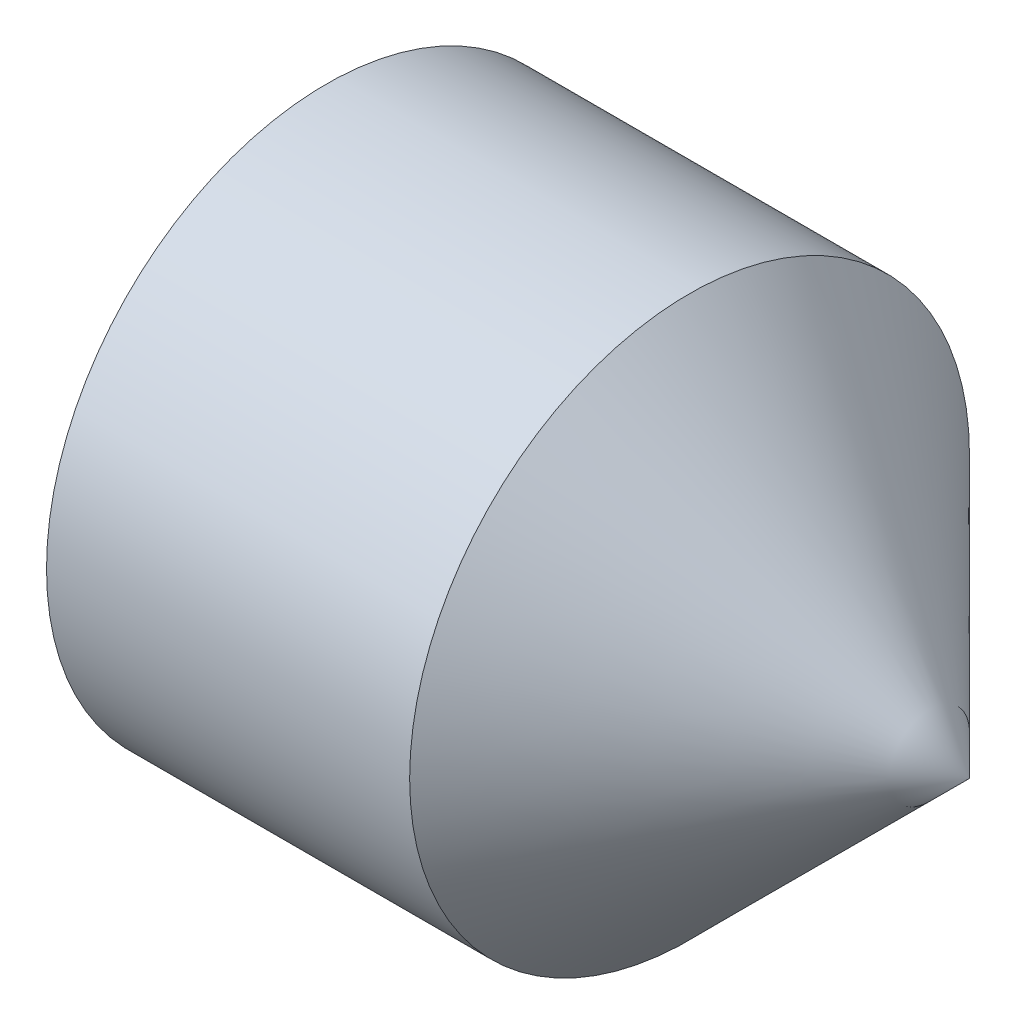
ISO-10303-21;
HEADER;
FILE_DESCRIPTION(('STEP AP214'),'2;1');
FILE_NAME('part.step','',(''),(''),'','','');
FILE_SCHEMA(('AUTOMOTIVE_DESIGN { 1 0 10303 214 1 1 1 1 }'));
ENDSEC;
DATA;
#1=APPLICATION_CONTEXT('core data for automotive mechanical design processes');
#2=APPLICATION_PROTOCOL_DEFINITION('international standard','automotive_design',2000,#1);
#3=PRODUCT_CONTEXT('',#1,'mechanical');
#4=PRODUCT('Part','Part','',(#3));
#5=PRODUCT_RELATED_PRODUCT_CATEGORY('part','',(#4));
#6=PRODUCT_DEFINITION_FORMATION('','',#4);
#7=PRODUCT_DEFINITION_CONTEXT('part definition',#1,'design');
#8=PRODUCT_DEFINITION('design','',#6,#7);
#9=PRODUCT_DEFINITION_SHAPE('','',#8);
#10=(LENGTH_UNIT() NAMED_UNIT(*) SI_UNIT(.MILLI.,.METRE.));
#11=(NAMED_UNIT(*) PLANE_ANGLE_UNIT() SI_UNIT($,.RADIAN.));
#12=(NAMED_UNIT(*) SI_UNIT($,.STERADIAN.) SOLID_ANGLE_UNIT());
#13=UNCERTAINTY_MEASURE_WITH_UNIT(LENGTH_MEASURE(1.E-05),#10,'distance_accuracy_value','');
#14=(GEOMETRIC_REPRESENTATION_CONTEXT(3) GLOBAL_UNCERTAINTY_ASSIGNED_CONTEXT((#13)) GLOBAL_UNIT_ASSIGNED_CONTEXT((#10,
#11,#12)) REPRESENTATION_CONTEXT('',''));
#15=CARTESIAN_POINT('',(0.,0.,0.));
#16=DIRECTION('',(0.,0.,1.));
#17=DIRECTION('',(1.,0.,0.));
#18=AXIS2_PLACEMENT_3D('',#15,#16,#17);
#19=CARTESIAN_POINT('',(0.,0.,0.));
#20=DIRECTION('',(-1.,0.,0.));
#21=DIRECTION('',(0.,0.,1.));
#22=AXIS2_PLACEMENT_3D('',#19,#20,#21);
#23=PLANE('',#22);
#24=CARTESIAN_POINT('',(0.,0.,0.));
#25=DIRECTION('',(-1.,0.,0.));
#26=DIRECTION('',(0.,0.,1.));
#27=AXIS2_PLACEMENT_3D('',#24,#25,#26);
#28=CIRCLE('',#27,2.055);
#29=CARTESIAN_POINT('',(0.,0.,2.055));
#30=VERTEX_POINT('',#29);
#31=EDGE_CURVE('E11',#30,#30,#28,.T.);
#32=ORIENTED_EDGE('',*,*,#31,.T.);
#33=EDGE_LOOP('',(#32));
#34=FACE_BOUND('',#33,.T.);
#35=DIRECTION('',(0.,0.,-1.));
#36=VECTOR('',#35,1.);
#37=CARTESIAN_POINT('',(0.,1.25,0.721687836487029));
#38=LINE('',#37,#36);
#39=CARTESIAN_POINT('',(0.,1.25,0.721687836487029));
#40=VERTEX_POINT('',#39);
#41=CARTESIAN_POINT('',(0.,1.25,-0.721687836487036));
#42=VERTEX_POINT('',#41);
#43=EDGE_CURVE('E91',#40,#42,#38,.T.);
#44=ORIENTED_EDGE('',*,*,#43,.F.);
#45=DIRECTION('',(0.,-0.866025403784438,0.500000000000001));
#46=VECTOR('',#45,1.);
#47=CARTESIAN_POINT('',(0.,1.25,0.721687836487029));
#48=LINE('',#47,#46);
#49=CARTESIAN_POINT('',(0.,0.,1.44337567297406));
#50=VERTEX_POINT('',#49);
#51=EDGE_CURVE('E44',#40,#50,#48,.T.);
#52=ORIENTED_EDGE('',*,*,#51,.T.);
#53=DIRECTION('',(0.,0.866025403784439,0.5));
#54=VECTOR('',#53,1.);
#55=CARTESIAN_POINT('',(0.,-1.25,0.721687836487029));
#56=LINE('',#55,#54);
#57=CARTESIAN_POINT('',(0.,-1.25,0.721687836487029));
#58=VERTEX_POINT('',#57);
#59=EDGE_CURVE('E97',#58,#50,#56,.T.);
#60=ORIENTED_EDGE('',*,*,#59,.F.);
#61=DIRECTION('',(0.,0.,-1.));
#62=VECTOR('',#61,1.);
#63=CARTESIAN_POINT('',(0.,-1.25,0.721687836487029));
#64=LINE('',#63,#62);
#65=CARTESIAN_POINT('',(0.,-1.25,-0.721687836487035));
#66=VERTEX_POINT('',#65);
#67=EDGE_CURVE('E117',#58,#66,#64,.T.);
#68=ORIENTED_EDGE('',*,*,#67,.T.);
#69=DIRECTION('',(0.,0.866025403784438,-0.500000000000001));
#70=VECTOR('',#69,1.);
#71=CARTESIAN_POINT('',(0.,-1.25,-0.721687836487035));
#72=LINE('',#71,#70);
#73=CARTESIAN_POINT('',(0.,0.,-1.44337567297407));
#74=VERTEX_POINT('',#73);
#75=EDGE_CURVE('E120',#66,#74,#72,.T.);
#76=ORIENTED_EDGE('',*,*,#75,.T.);
#77=DIRECTION('',(0.,-0.866025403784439,-0.5));
#78=VECTOR('',#77,1.);
#79=CARTESIAN_POINT('',(0.,1.25,-0.721687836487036));
#80=LINE('',#79,#78);
#81=EDGE_CURVE('E123',#42,#74,#80,.T.);
#82=ORIENTED_EDGE('',*,*,#81,.F.);
#83=EDGE_LOOP('',(#44,#52,#60,#68,#76,#82));
#84=FACE_BOUND('',#83,.T.);
#85=ADVANCED_FACE('F30',(#34,#84),#23,.T.);
#86=CARTESIAN_POINT('',(0.,0.,0.));
#87=DIRECTION('',(1.,0.,0.));
#88=DIRECTION('',(0.,0.,-1.));
#89=AXIS2_PLACEMENT_3D('',#86,#87,#88);
#90=CONICAL_SURFACE('',#89,2.055,1.0471975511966);
#91=CARTESIAN_POINT('',(0.256920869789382,0.,0.));
#92=DIRECTION('',(-1.,0.,0.));
#93=DIRECTION('',(0.,0.,1.));
#94=AXIS2_PLACEMENT_3D('',#91,#92,#93);
#95=CIRCLE('',#94,2.5);
#96=CARTESIAN_POINT('',(0.256920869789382,0.,2.5));
#97=VERTEX_POINT('',#96);
#98=EDGE_CURVE('E37',#97,#97,#95,.T.);
#99=ORIENTED_EDGE('',*,*,#98,.T.);
#100=EDGE_LOOP('',(#99));
#101=FACE_BOUND('',#100,.T.);
#102=ORIENTED_EDGE('',*,*,#31,.F.);
#103=EDGE_LOOP('',(#102));
#104=FACE_BOUND('',#103,.T.);
#105=ADVANCED_FACE('F140',(#101,#104),#90,.T.);
#106=CARTESIAN_POINT('',(-12.7,0.,0.));
#107=DIRECTION('',(-1.,0.,0.));
#108=DIRECTION('',(0.,0.,1.));
#109=AXIS2_PLACEMENT_3D('',#106,#107,#108);
#110=CYLINDRICAL_SURFACE('',#109,2.5);
#111=CARTESIAN_POINT('',(3.50000000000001,0.,0.));
#112=DIRECTION('',(-1.,0.,0.));
#113=DIRECTION('',(0.,0.,1.));
#114=AXIS2_PLACEMENT_3D('',#111,#112,#113);
#115=CIRCLE('',#114,2.5);
#116=CARTESIAN_POINT('',(3.50000000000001,0.,2.5));
#117=VERTEX_POINT('',#116);
#118=EDGE_CURVE('E98',#117,#117,#115,.T.);
#119=ORIENTED_EDGE('',*,*,#118,.T.);
#120=EDGE_LOOP('',(#119));
#121=FACE_BOUND('',#120,.T.);
#122=ORIENTED_EDGE('',*,*,#98,.F.);
#123=EDGE_LOOP('',(#122));
#124=FACE_BOUND('',#123,.T.);
#125=ADVANCED_FACE('F143',(#121,#124),#110,.T.);
#126=CARTESIAN_POINT('',(3.50000000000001,0.,0.));
#127=DIRECTION('',(-1.,0.,0.));
#128=DIRECTION('',(0.,0.,1.));
#129=AXIS2_PLACEMENT_3D('',#126,#127,#128);
#130=CONICAL_SURFACE('',#129,2.5,0.78539816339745);
#131=CARTESIAN_POINT('',(6.,0.,0.));
#132=VERTEX_POINT('',#131);
#133=VERTEX_LOOP('',#132);
#134=FACE_BOUND('',#133,.T.);
#135=ORIENTED_EDGE('',*,*,#118,.F.);
#136=EDGE_LOOP('',(#135));
#137=FACE_BOUND('',#136,.T.);
#138=ADVANCED_FACE('F145',(#134,#137),#130,.T.);
#139=CARTESIAN_POINT('',(3.,1.25,0.721687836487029));
#140=DIRECTION('',(0.,-0.500000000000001,-0.866025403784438));
#141=DIRECTION('',(0.,0.866025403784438,-0.500000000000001));
#142=AXIS2_PLACEMENT_3D('',#139,#140,#141);
#143=PLANE('',#142);
#144=ORIENTED_EDGE('',*,*,#51,.F.);
#145=DIRECTION('',(-1.,0.,0.));
#146=VECTOR('',#145,1.);
#147=CARTESIAN_POINT('',(3.,1.25,0.721687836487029));
#148=LINE('',#147,#146);
#149=CARTESIAN_POINT('',(3.,1.25,0.721687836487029));
#150=VERTEX_POINT('',#149);
#151=EDGE_CURVE('E85',#150,#40,#148,.T.);
#152=ORIENTED_EDGE('',*,*,#151,.F.);
#153=DIRECTION('',(0.,-0.866025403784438,0.500000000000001));
#154=VECTOR('',#153,1.);
#155=CARTESIAN_POINT('',(3.,1.25,0.721687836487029));
#156=LINE('',#155,#154);
#157=CARTESIAN_POINT('',(3.,0.,1.44337567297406));
#158=VERTEX_POINT('',#157);
#159=EDGE_CURVE('E80',#150,#158,#156,.T.);
#160=ORIENTED_EDGE('',*,*,#159,.T.);
#161=DIRECTION('',(-1.,0.,0.));
#162=VECTOR('',#161,1.);
#163=CARTESIAN_POINT('',(3.,0.,1.44337567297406));
#164=LINE('',#163,#162);
#165=EDGE_CURVE('E83',#158,#50,#164,.T.);
#166=ORIENTED_EDGE('',*,*,#165,.T.);
#167=EDGE_LOOP('',(#144,#152,#160,#166));
#168=FACE_BOUND('',#167,.T.);
#169=ADVANCED_FACE('F82',(#168),#143,.T.);
#170=CARTESIAN_POINT('',(3.,-1.25,0.721687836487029));
#171=DIRECTION('',(0.,-0.5,0.866025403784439));
#172=DIRECTION('',(0.,-0.866025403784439,-0.5));
#173=AXIS2_PLACEMENT_3D('',#170,#171,#172);
#174=PLANE('',#173);
#175=ORIENTED_EDGE('',*,*,#59,.T.);
#176=ORIENTED_EDGE('',*,*,#165,.F.);
#177=DIRECTION('',(0.,0.866025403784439,0.5));
#178=VECTOR('',#177,1.);
#179=CARTESIAN_POINT('',(3.,-1.25,0.721687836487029));
#180=LINE('',#179,#178);
#181=CARTESIAN_POINT('',(3.,-1.25,0.721687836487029));
#182=VERTEX_POINT('',#181);
#183=EDGE_CURVE('E90',#182,#158,#180,.T.);
#184=ORIENTED_EDGE('',*,*,#183,.F.);
#185=DIRECTION('',(-1.,0.,0.));
#186=VECTOR('',#185,1.);
#187=CARTESIAN_POINT('',(3.,-1.25,0.721687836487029));
#188=LINE('',#187,#186);
#189=EDGE_CURVE('E99',#182,#58,#188,.T.);
#190=ORIENTED_EDGE('',*,*,#189,.T.);
#191=EDGE_LOOP('',(#175,#176,#184,#190));
#192=FACE_BOUND('',#191,.T.);
#193=ADVANCED_FACE('F95',(#192),#174,.F.);
#194=CARTESIAN_POINT('',(3.,-1.25,0.721687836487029));
#195=DIRECTION('',(0.,1.,0.));
#196=DIRECTION('',(0.,0.,1.));
#197=AXIS2_PLACEMENT_3D('',#194,#195,#196);
#198=PLANE('',#197);
#199=ORIENTED_EDGE('',*,*,#67,.F.);
#200=ORIENTED_EDGE('',*,*,#189,.F.);
#201=DIRECTION('',(0.,0.,-1.));
#202=VECTOR('',#201,1.);
#203=CARTESIAN_POINT('',(3.,-1.25,0.721687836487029));
#204=LINE('',#203,#202);
#205=CARTESIAN_POINT('',(3.,-1.25,-0.721687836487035));
#206=VERTEX_POINT('',#205);
#207=EDGE_CURVE('E104',#182,#206,#204,.T.);
#208=ORIENTED_EDGE('',*,*,#207,.T.);
#209=DIRECTION('',(-1.,0.,0.));
#210=VECTOR('',#209,1.);
#211=CARTESIAN_POINT('',(3.,-1.25,-0.721687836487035));
#212=LINE('',#211,#210);
#213=EDGE_CURVE('E133',#206,#66,#212,.T.);
#214=ORIENTED_EDGE('',*,*,#213,.T.);
#215=EDGE_LOOP('',(#199,#200,#208,#214));
#216=FACE_BOUND('',#215,.T.);
#217=ADVANCED_FACE('F173',(#216),#198,.T.);
#218=CARTESIAN_POINT('',(3.,-1.25,-0.721687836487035));
#219=DIRECTION('',(0.,0.500000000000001,0.866025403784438));
#220=DIRECTION('',(0.,-0.866025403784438,0.500000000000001));
#221=AXIS2_PLACEMENT_3D('',#218,#219,#220);
#222=PLANE('',#221);
#223=ORIENTED_EDGE('',*,*,#75,.F.);
#224=ORIENTED_EDGE('',*,*,#213,.F.);
#225=DIRECTION('',(0.,0.866025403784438,-0.500000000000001));
#226=VECTOR('',#225,1.);
#227=CARTESIAN_POINT('',(3.,-1.25,-0.721687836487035));
#228=LINE('',#227,#226);
#229=CARTESIAN_POINT('',(3.,0.,-1.44337567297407));
#230=VERTEX_POINT('',#229);
#231=EDGE_CURVE('E106',#206,#230,#228,.T.);
#232=ORIENTED_EDGE('',*,*,#231,.T.);
#233=DIRECTION('',(-1.,0.,0.));
#234=VECTOR('',#233,1.);
#235=CARTESIAN_POINT('',(3.,0.,-1.44337567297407));
#236=LINE('',#235,#234);
#237=EDGE_CURVE('E131',#230,#74,#236,.T.);
#238=ORIENTED_EDGE('',*,*,#237,.T.);
#239=EDGE_LOOP('',(#223,#224,#232,#238));
#240=FACE_BOUND('',#239,.T.);
#241=ADVANCED_FACE('F169',(#240),#222,.T.);
#242=CARTESIAN_POINT('',(3.,1.25,-0.721687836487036));
#243=DIRECTION('',(0.,0.5,-0.866025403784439));
#244=DIRECTION('',(0.,0.866025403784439,0.5));
#245=AXIS2_PLACEMENT_3D('',#242,#243,#244);
#246=PLANE('',#245);
#247=ORIENTED_EDGE('',*,*,#81,.T.);
#248=ORIENTED_EDGE('',*,*,#237,.F.);
#249=DIRECTION('',(0.,-0.866025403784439,-0.5));
#250=VECTOR('',#249,1.);
#251=CARTESIAN_POINT('',(3.,1.25,-0.721687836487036));
#252=LINE('',#251,#250);
#253=CARTESIAN_POINT('',(3.,1.25,-0.721687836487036));
#254=VERTEX_POINT('',#253);
#255=EDGE_CURVE('E110',#254,#230,#252,.T.);
#256=ORIENTED_EDGE('',*,*,#255,.F.);
#257=DIRECTION('',(-1.,0.,0.));
#258=VECTOR('',#257,1.);
#259=CARTESIAN_POINT('',(3.,1.25,-0.721687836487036));
#260=LINE('',#259,#258);
#261=EDGE_CURVE('E129',#254,#42,#260,.T.);
#262=ORIENTED_EDGE('',*,*,#261,.T.);
#263=EDGE_LOOP('',(#247,#248,#256,#262));
#264=FACE_BOUND('',#263,.T.);
#265=ADVANCED_FACE('F166',(#264),#246,.F.);
#266=CARTESIAN_POINT('',(3.,1.25,0.721687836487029));
#267=DIRECTION('',(0.,1.,0.));
#268=DIRECTION('',(0.,0.,1.));
#269=AXIS2_PLACEMENT_3D('',#266,#267,#268);
#270=PLANE('',#269);
#271=ORIENTED_EDGE('',*,*,#43,.T.);
#272=ORIENTED_EDGE('',*,*,#261,.F.);
#273=DIRECTION('',(0.,0.,-1.));
#274=VECTOR('',#273,1.);
#275=CARTESIAN_POINT('',(3.,1.25,0.721687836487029));
#276=LINE('',#275,#274);
#277=EDGE_CURVE('E113',#150,#254,#276,.T.);
#278=ORIENTED_EDGE('',*,*,#277,.F.);
#279=ORIENTED_EDGE('',*,*,#151,.T.);
#280=EDGE_LOOP('',(#271,#272,#278,#279));
#281=FACE_BOUND('',#280,.T.);
#282=ADVANCED_FACE('F162',(#281),#270,.F.);
#283=CARTESIAN_POINT('',(3.,0.,1.44337567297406));
#284=DIRECTION('',(-1.,0.,0.));
#285=DIRECTION('',(0.,0.,1.));
#286=AXIS2_PLACEMENT_3D('',#283,#284,#285);
#287=PLANE('',#286);
#288=ORIENTED_EDGE('',*,*,#159,.F.);
#289=ORIENTED_EDGE('',*,*,#277,.T.);
#290=ORIENTED_EDGE('',*,*,#255,.T.);
#291=ORIENTED_EDGE('',*,*,#231,.F.);
#292=ORIENTED_EDGE('',*,*,#207,.F.);
#293=ORIENTED_EDGE('',*,*,#183,.T.);
#294=EDGE_LOOP('',(#288,#289,#290,#291,#292,#293));
#295=FACE_BOUND('',#294,.T.);
#296=ADVANCED_FACE('F102',(#295),#287,.T.);
#297=CLOSED_SHELL('',(#85,#105,#125,#138,#169,#193,#217,#241,#265,#282,#296));
#298=MANIFOLD_SOLID_BREP('B2',#297);
#299=ADVANCED_BREP_SHAPE_REPRESENTATION('',(#18,#298),#14);
#300=SHAPE_DEFINITION_REPRESENTATION(#9,#299);
ENDSEC;
END-ISO-10303-21;
